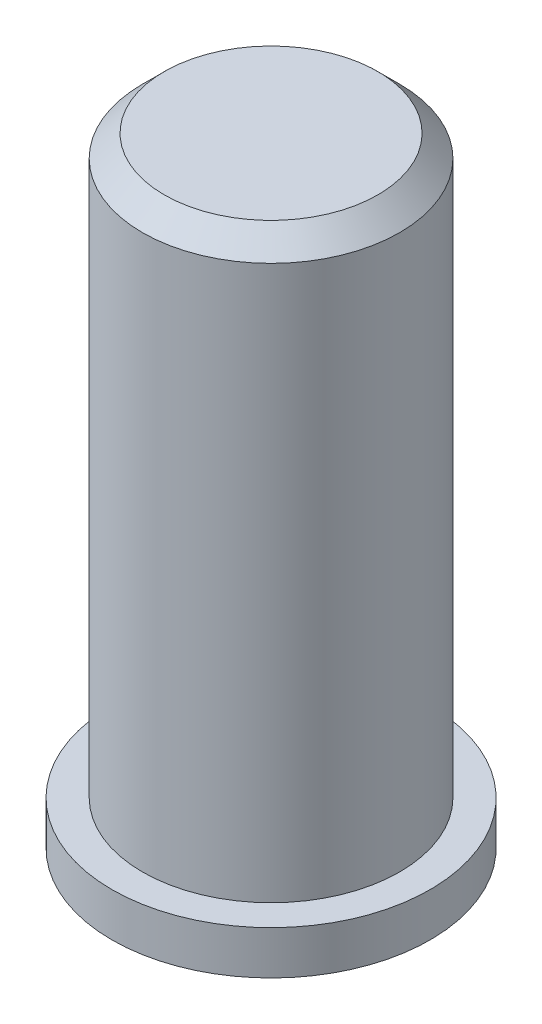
ISO-10303-21;
HEADER;
FILE_DESCRIPTION(('STEP AP214'),'2;1');
FILE_NAME('part.step','',(''),(''),'','','');
FILE_SCHEMA(('AUTOMOTIVE_DESIGN { 1 0 10303 214 1 1 1 1 }'));
ENDSEC;
DATA;
#1=APPLICATION_CONTEXT('core data for automotive mechanical design processes');
#2=APPLICATION_PROTOCOL_DEFINITION('international standard','automotive_design',2000,#1);
#3=PRODUCT_CONTEXT('',#1,'mechanical');
#4=PRODUCT('Part','Part','',(#3));
#5=PRODUCT_RELATED_PRODUCT_CATEGORY('part','',(#4));
#6=PRODUCT_DEFINITION_FORMATION('','',#4);
#7=PRODUCT_DEFINITION_CONTEXT('part definition',#1,'design');
#8=PRODUCT_DEFINITION('design','',#6,#7);
#9=PRODUCT_DEFINITION_SHAPE('','',#8);
#10=(LENGTH_UNIT() NAMED_UNIT(*) SI_UNIT(.MILLI.,.METRE.));
#11=(NAMED_UNIT(*) PLANE_ANGLE_UNIT() SI_UNIT($,.RADIAN.));
#12=(NAMED_UNIT(*) SI_UNIT($,.STERADIAN.) SOLID_ANGLE_UNIT());
#13=UNCERTAINTY_MEASURE_WITH_UNIT(LENGTH_MEASURE(1.E-05),#10,'distance_accuracy_value','');
#14=(GEOMETRIC_REPRESENTATION_CONTEXT(3) GLOBAL_UNCERTAINTY_ASSIGNED_CONTEXT((#13)) GLOBAL_UNIT_ASSIGNED_CONTEXT((#10,
#11,#12)) REPRESENTATION_CONTEXT('',''));
#15=CARTESIAN_POINT('',(0.,0.,0.));
#16=DIRECTION('',(0.,0.,1.));
#17=DIRECTION('',(1.,0.,0.));
#18=AXIS2_PLACEMENT_3D('',#15,#16,#17);
#19=CARTESIAN_POINT('',(2.45,14.2,0.));
#20=DIRECTION('',(0.,-1.,0.));
#21=DIRECTION('',(0.,0.,-1.));
#22=AXIS2_PLACEMENT_3D('',#19,#20,#21);
#23=PLANE('',#22);
#24=CARTESIAN_POINT('',(0.,14.2,0.));
#25=DIRECTION('',(0.,1.,0.));
#26=DIRECTION('',(0.,0.,1.));
#27=AXIS2_PLACEMENT_3D('',#24,#25,#26);
#28=CIRCLE('',#27,2.45);
#29=CARTESIAN_POINT('',(0.,14.2,2.45));
#30=VERTEX_POINT('',#29);
#31=EDGE_CURVE('E71',#30,#30,#28,.T.);
#32=ORIENTED_EDGE('',*,*,#31,.T.);
#33=EDGE_LOOP('',(#32));
#34=FACE_BOUND('',#33,.T.);
#35=ADVANCED_FACE('F37',(#34),#23,.F.);
#36=CARTESIAN_POINT('',(0.,-0.5,0.));
#37=DIRECTION('',(0.,1.,0.));
#38=DIRECTION('',(0.,0.,1.));
#39=AXIS2_PLACEMENT_3D('',#36,#37,#38);
#40=PLANE('',#39);
#41=CARTESIAN_POINT('',(0.,-0.5,0.));
#42=DIRECTION('',(0.,1.,0.));
#43=DIRECTION('',(0.,0.,1.));
#44=AXIS2_PLACEMENT_3D('',#41,#42,#43);
#45=CIRCLE('',#44,0.4);
#46=CARTESIAN_POINT('',(0.,-0.5,0.4));
#47=VERTEX_POINT('',#46);
#48=EDGE_CURVE('E10',#47,#47,#45,.T.);
#49=ORIENTED_EDGE('',*,*,#48,.F.);
#50=EDGE_LOOP('',(#49));
#51=FACE_BOUND('',#50,.T.);
#52=ADVANCED_FACE('F109',(#51),#40,.F.);
#53=CARTESIAN_POINT('',(0.,14.2,0.));
#54=DIRECTION('',(0.,1.,0.));
#55=DIRECTION('',(0.,0.,1.));
#56=AXIS2_PLACEMENT_3D('',#53,#54,#55);
#57=CYLINDRICAL_SURFACE('',#56,0.4);
#58=CARTESIAN_POINT('',(0.,0.,0.));
#59=DIRECTION('',(0.,1.,0.));
#60=DIRECTION('',(0.,0.,1.));
#61=AXIS2_PLACEMENT_3D('',#58,#59,#60);
#62=CIRCLE('',#61,0.4);
#63=CARTESIAN_POINT('',(0.,0.,0.4));
#64=VERTEX_POINT('',#63);
#65=EDGE_CURVE('E44',#64,#64,#62,.T.);
#66=ORIENTED_EDGE('',*,*,#65,.F.);
#67=EDGE_LOOP('',(#66));
#68=FACE_BOUND('',#67,.T.);
#69=ORIENTED_EDGE('',*,*,#48,.T.);
#70=EDGE_LOOP('',(#69));
#71=FACE_BOUND('',#70,.T.);
#72=ADVANCED_FACE('F104',(#68,#71),#57,.T.);
#73=CARTESIAN_POINT('',(0.4,0.,0.));
#74=DIRECTION('',(0.,1.,0.));
#75=DIRECTION('',(0.,0.,1.));
#76=AXIS2_PLACEMENT_3D('',#73,#74,#75);
#77=PLANE('',#76);
#78=CARTESIAN_POINT('',(0.,0.,0.));
#79=DIRECTION('',(0.,1.,0.));
#80=DIRECTION('',(0.,0.,1.));
#81=AXIS2_PLACEMENT_3D('',#78,#79,#80);
#82=CIRCLE('',#81,3.65);
#83=CARTESIAN_POINT('',(0.,0.,3.65));
#84=VERTEX_POINT('',#83);
#85=EDGE_CURVE('E51',#84,#84,#82,.T.);
#86=ORIENTED_EDGE('',*,*,#85,.F.);
#87=EDGE_LOOP('',(#86));
#88=FACE_BOUND('',#87,.T.);
#89=ORIENTED_EDGE('',*,*,#65,.T.);
#90=EDGE_LOOP('',(#89));
#91=FACE_BOUND('',#90,.T.);
#92=ADVANCED_FACE('F99',(#88,#91),#77,.F.);
#93=CARTESIAN_POINT('',(0.,14.2,0.));
#94=DIRECTION('',(0.,1.,0.));
#95=DIRECTION('',(0.,0.,1.));
#96=AXIS2_PLACEMENT_3D('',#93,#94,#95);
#97=CYLINDRICAL_SURFACE('',#96,3.65);
#98=CARTESIAN_POINT('',(0.,0.999999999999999,0.));
#99=DIRECTION('',(0.,1.,0.));
#100=DIRECTION('',(0.,0.,1.));
#101=AXIS2_PLACEMENT_3D('',#98,#99,#100);
#102=CIRCLE('',#101,3.65);
#103=CARTESIAN_POINT('',(0.,0.999999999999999,3.65));
#104=VERTEX_POINT('',#103);
#105=EDGE_CURVE('E58',#104,#104,#102,.T.);
#106=ORIENTED_EDGE('',*,*,#105,.F.);
#107=EDGE_LOOP('',(#106));
#108=FACE_BOUND('',#107,.T.);
#109=ORIENTED_EDGE('',*,*,#85,.T.);
#110=EDGE_LOOP('',(#109));
#111=FACE_BOUND('',#110,.T.);
#112=ADVANCED_FACE('F93',(#108,#111),#97,.T.);
#113=CARTESIAN_POINT('',(3.65,1.,0.));
#114=DIRECTION('',(0.,-1.,0.));
#115=DIRECTION('',(0.,0.,-1.));
#116=AXIS2_PLACEMENT_3D('',#113,#114,#115);
#117=PLANE('',#116);
#118=CARTESIAN_POINT('',(0.,0.999999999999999,0.));
#119=DIRECTION('',(0.,1.,0.));
#120=DIRECTION('',(0.,0.,1.));
#121=AXIS2_PLACEMENT_3D('',#118,#119,#120);
#122=CIRCLE('',#121,2.95);
#123=CARTESIAN_POINT('',(0.,0.999999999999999,2.95));
#124=VERTEX_POINT('',#123);
#125=EDGE_CURVE('E64',#124,#124,#122,.T.);
#126=ORIENTED_EDGE('',*,*,#125,.F.);
#127=EDGE_LOOP('',(#126));
#128=FACE_BOUND('',#127,.T.);
#129=ORIENTED_EDGE('',*,*,#105,.T.);
#130=EDGE_LOOP('',(#129));
#131=FACE_BOUND('',#130,.T.);
#132=ADVANCED_FACE('F87',(#128,#131),#117,.F.);
#133=CARTESIAN_POINT('',(0.,14.2,0.));
#134=DIRECTION('',(0.,1.,0.));
#135=DIRECTION('',(0.,0.,1.));
#136=AXIS2_PLACEMENT_3D('',#133,#134,#135);
#137=CYLINDRICAL_SURFACE('',#136,2.95);
#138=CARTESIAN_POINT('',(0.,13.7,0.));
#139=DIRECTION('',(0.,1.,0.));
#140=DIRECTION('',(0.,0.,1.));
#141=AXIS2_PLACEMENT_3D('',#138,#139,#140);
#142=CIRCLE('',#141,2.95);
#143=CARTESIAN_POINT('',(0.,13.7,2.95));
#144=VERTEX_POINT('',#143);
#145=EDGE_CURVE('E67',#144,#144,#142,.T.);
#146=ORIENTED_EDGE('',*,*,#145,.F.);
#147=EDGE_LOOP('',(#146));
#148=FACE_BOUND('',#147,.T.);
#149=ORIENTED_EDGE('',*,*,#125,.T.);
#150=EDGE_LOOP('',(#149));
#151=FACE_BOUND('',#150,.T.);
#152=ADVANCED_FACE('F81',(#148,#151),#137,.T.);
#153=CARTESIAN_POINT('',(0.,13.7,0.));
#154=DIRECTION('',(0.,-1.,0.));
#155=DIRECTION('',(0.,0.,-1.));
#156=AXIS2_PLACEMENT_3D('',#153,#154,#155);
#157=CONICAL_SURFACE('',#156,2.95,0.785398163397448);
#158=ORIENTED_EDGE('',*,*,#31,.F.);
#159=EDGE_LOOP('',(#158));
#160=FACE_BOUND('',#159,.T.);
#161=ORIENTED_EDGE('',*,*,#145,.T.);
#162=EDGE_LOOP('',(#161));
#163=FACE_BOUND('',#162,.T.);
#164=ADVANCED_FACE('F78',(#160,#163),#157,.T.);
#165=CLOSED_SHELL('',(#35,#52,#72,#92,#112,#132,#152,#164));
#166=MANIFOLD_SOLID_BREP('B2',#165);
#167=ADVANCED_BREP_SHAPE_REPRESENTATION('',(#18,#166),#14);
#168=SHAPE_DEFINITION_REPRESENTATION(#9,#167);
ENDSEC;
END-ISO-10303-21;
